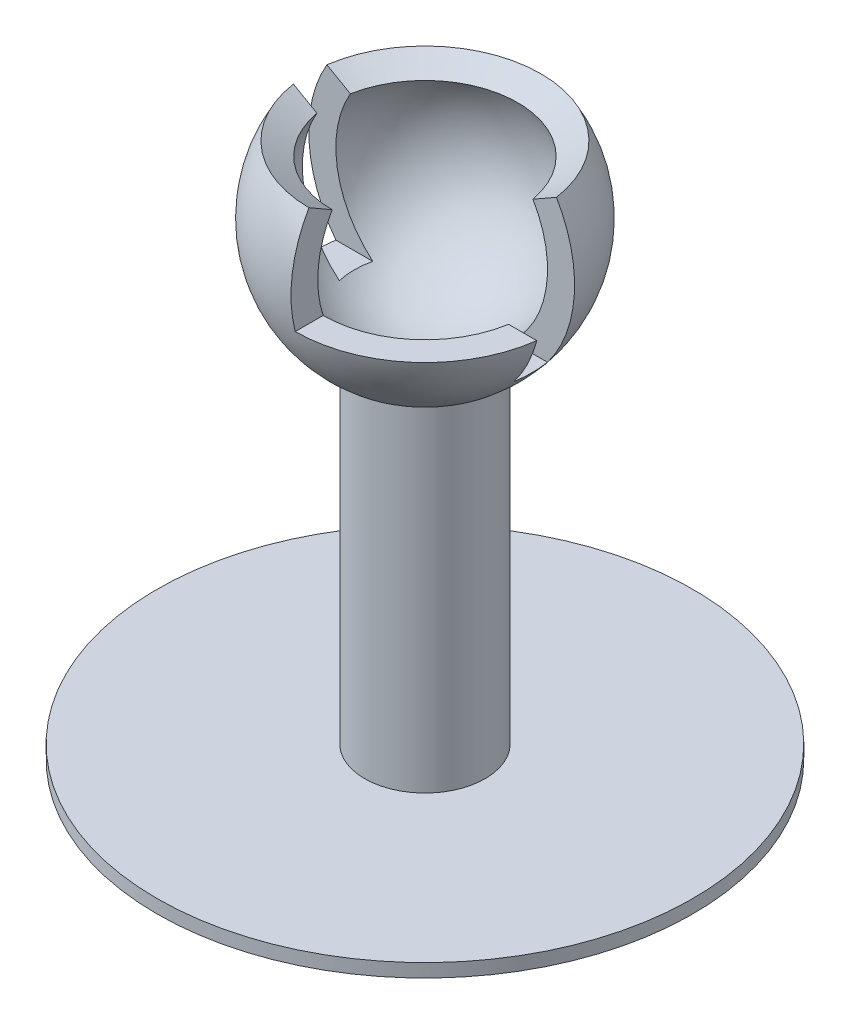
ISO-10303-21;
HEADER;
FILE_DESCRIPTION(('STEP AP214'),'2;1');
FILE_NAME('part.step','',(''),(''),'','','');
FILE_SCHEMA(('AUTOMOTIVE_DESIGN { 1 0 10303 214 1 1 1 1 }'));
ENDSEC;
DATA;
#1=APPLICATION_CONTEXT('core data for automotive mechanical design processes');
#2=APPLICATION_PROTOCOL_DEFINITION('international standard','automotive_design',2000,#1);
#3=PRODUCT_CONTEXT('',#1,'mechanical');
#4=PRODUCT('Part','Part','',(#3));
#5=PRODUCT_RELATED_PRODUCT_CATEGORY('part','',(#4));
#6=PRODUCT_DEFINITION_FORMATION('','',#4);
#7=PRODUCT_DEFINITION_CONTEXT('part definition',#1,'design');
#8=PRODUCT_DEFINITION('design','',#6,#7);
#9=PRODUCT_DEFINITION_SHAPE('','',#8);
#10=(LENGTH_UNIT() NAMED_UNIT(*) SI_UNIT(.MILLI.,.METRE.));
#11=(NAMED_UNIT(*) PLANE_ANGLE_UNIT() SI_UNIT($,.RADIAN.));
#12=(NAMED_UNIT(*) SI_UNIT($,.STERADIAN.) SOLID_ANGLE_UNIT());
#13=UNCERTAINTY_MEASURE_WITH_UNIT(LENGTH_MEASURE(1.E-05),#10,'distance_accuracy_value','');
#14=(GEOMETRIC_REPRESENTATION_CONTEXT(3) GLOBAL_UNCERTAINTY_ASSIGNED_CONTEXT((#13)) GLOBAL_UNIT_ASSIGNED_CONTEXT((#10,
#11,#12)) REPRESENTATION_CONTEXT('',''));
#15=CARTESIAN_POINT('',(0.,0.,0.));
#16=DIRECTION('',(0.,0.,1.));
#17=DIRECTION('',(1.,0.,0.));
#18=AXIS2_PLACEMENT_3D('',#15,#16,#17);
#19=CARTESIAN_POINT('',(0.,0.,0.));
#20=DIRECTION('',(0.,1.,0.));
#21=DIRECTION('',(-1.,0.,0.));
#22=AXIS2_PLACEMENT_3D('',#19,#20,#21);
#23=SPHERICAL_SURFACE('',#22,20.);
#24=CARTESIAN_POINT('',(0.,-17.8605710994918,0.));
#25=DIRECTION('',(0.,1.,0.));
#26=DIRECTION('',(0.,0.,1.));
#27=AXIS2_PLACEMENT_3D('',#24,#25,#26);
#28=CIRCLE('',#27,9.);
#29=CARTESIAN_POINT('',(0.,-17.8605710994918,9.));
#30=VERTEX_POINT('',#29);
#31=EDGE_CURVE('E139',#30,#30,#28,.T.);
#32=ORIENTED_EDGE('',*,*,#31,.T.);
#33=EDGE_LOOP('',(#32));
#34=FACE_BOUND('',#33,.T.);
#35=CARTESIAN_POINT('',(0.,-12.,0.));
#36=DIRECTION('',(0.,-1.,0.));
#37=DIRECTION('',(0.,0.,-1.));
#38=AXIS2_PLACEMENT_3D('',#35,#36,#37);
#39=CIRCLE('',#38,16.);
#40=CARTESIAN_POINT('',(-15.8034806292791,-12.,2.5));
#41=VERTEX_POINT('',#40);
#42=CARTESIAN_POINT('',(-15.8034806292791,-12.,-2.5));
#43=VERTEX_POINT('',#42);
#44=EDGE_CURVE('E120',#41,#43,#39,.T.);
#45=ORIENTED_EDGE('',*,*,#44,.T.);
#46=CARTESIAN_POINT('',(0.,0.,-2.5));
#47=DIRECTION('',(0.,0.,1.));
#48=DIRECTION('',(1.,0.,0.));
#49=AXIS2_PLACEMENT_3D('',#46,#47,#48);
#50=CIRCLE('',#49,19.8431348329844);
#51=CARTESIAN_POINT('',(-17.1391365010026,10.0000000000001,-2.5));
#52=VERTEX_POINT('',#51);
#53=EDGE_CURVE('E123',#52,#43,#50,.T.);
#54=ORIENTED_EDGE('',*,*,#53,.F.);
#55=CARTESIAN_POINT('',(0.,10.0000000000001,0.));
#56=DIRECTION('',(0.,1.,0.));
#57=DIRECTION('',(0.,0.,1.));
#58=AXIS2_PLACEMENT_3D('',#55,#56,#57);
#59=CIRCLE('',#58,17.3205080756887);
#60=CARTESIAN_POINT('',(17.1391365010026,10.0000000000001,-2.5));
#61=VERTEX_POINT('',#60);
#62=EDGE_CURVE('E129',#61,#52,#59,.T.);
#63=ORIENTED_EDGE('',*,*,#62,.F.);
#64=CARTESIAN_POINT('',(15.8034806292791,-12.,-2.5));
#65=VERTEX_POINT('',#64);
#66=EDGE_CURVE('E111',#65,#61,#50,.T.);
#67=ORIENTED_EDGE('',*,*,#66,.F.);
#68=CARTESIAN_POINT('',(15.8034806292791,-12.,2.5));
#69=VERTEX_POINT('',#68);
#70=EDGE_CURVE('E191',#65,#69,#39,.T.);
#71=ORIENTED_EDGE('',*,*,#70,.T.);
#72=CARTESIAN_POINT('',(0.,0.,2.5));
#73=DIRECTION('',(0.,0.,1.));
#74=DIRECTION('',(1.,0.,0.));
#75=AXIS2_PLACEMENT_3D('',#72,#73,#74);
#76=CIRCLE('',#75,19.8431348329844);
#77=CARTESIAN_POINT('',(19.2028643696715,-4.99999999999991,2.5));
#78=VERTEX_POINT('',#77);
#79=EDGE_CURVE('E187',#69,#78,#76,.T.);
#80=ORIENTED_EDGE('',*,*,#79,.T.);
#81=CARTESIAN_POINT('',(0.,-4.99999999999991,0.));
#82=DIRECTION('',(0.,1.,0.));
#83=DIRECTION('',(0.,0.,1.));
#84=AXIS2_PLACEMENT_3D('',#81,#82,#83);
#85=CIRCLE('',#84,19.3649167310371);
#86=CARTESIAN_POINT('',(0.,-4.99999999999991,19.3649167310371));
#87=VERTEX_POINT('',#86);
#88=EDGE_CURVE('E200',#87,#78,#85,.T.);
#89=ORIENTED_EDGE('',*,*,#88,.F.);
#90=CARTESIAN_POINT('',(0.,0.,0.));
#91=DIRECTION('',(1.,0.,0.));
#92=DIRECTION('',(0.,0.,-1.));
#93=AXIS2_PLACEMENT_3D('',#90,#91,#92);
#94=CIRCLE('',#93,20.);
#95=CARTESIAN_POINT('',(0.,10.0000000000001,17.3205080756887));
#96=VERTEX_POINT('',#95);
#97=EDGE_CURVE('E199',#96,#87,#94,.T.);
#98=ORIENTED_EDGE('',*,*,#97,.F.);
#99=CARTESIAN_POINT('',(-17.1391365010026,10.0000000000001,2.5));
#100=VERTEX_POINT('',#99);
#101=EDGE_CURVE('E136',#100,#96,#59,.T.);
#102=ORIENTED_EDGE('',*,*,#101,.F.);
#103=EDGE_CURVE('E47',#100,#41,#76,.T.);
#104=ORIENTED_EDGE('',*,*,#103,.T.);
#105=EDGE_LOOP('',(#45,#54,#63,#67,#71,#80,#89,#98,#102,#104));
#106=FACE_BOUND('',#105,.T.);
#107=ADVANCED_FACE('F32',(#34,#106),#23,.T.);
#108=CARTESIAN_POINT('',(0.,0.,0.));
#109=DIRECTION('',(0.,1.,0.));
#110=DIRECTION('',(1.,0.,0.));
#111=AXIS2_PLACEMENT_3D('',#108,#109,#110);
#112=SPHERICAL_SURFACE('',#111,16.);
#113=CARTESIAN_POINT('',(0.,0.,-2.5));
#114=DIRECTION('',(0.,0.,1.));
#115=DIRECTION('',(1.,0.,0.));
#116=AXIS2_PLACEMENT_3D('',#113,#114,#115);
#117=CIRCLE('',#116,15.8034806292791);
#118=CARTESIAN_POINT('',(-10.2834819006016,-12.,-2.5));
#119=VERTEX_POINT('',#118);
#120=CARTESIAN_POINT('',(-13.629013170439,8.00000000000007,-2.5));
#121=VERTEX_POINT('',#120);
#122=EDGE_CURVE('E189',#119,#121,#117,.F.);
#123=ORIENTED_EDGE('',*,*,#122,.F.);
#124=CARTESIAN_POINT('',(0.,-12.,0.));
#125=DIRECTION('',(0.,-1.,0.));
#126=DIRECTION('',(0.,0.,-1.));
#127=AXIS2_PLACEMENT_3D('',#124,#125,#126);
#128=CIRCLE('',#127,10.5830052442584);
#129=CARTESIAN_POINT('',(-10.2834819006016,-12.,2.5));
#130=VERTEX_POINT('',#129);
#131=EDGE_CURVE('E11',#119,#130,#128,.F.);
#132=ORIENTED_EDGE('',*,*,#131,.T.);
#133=CARTESIAN_POINT('',(0.,0.,2.5));
#134=DIRECTION('',(0.,0.,1.));
#135=DIRECTION('',(1.,0.,0.));
#136=AXIS2_PLACEMENT_3D('',#133,#134,#135);
#137=CIRCLE('',#136,15.8034806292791);
#138=CARTESIAN_POINT('',(-13.629013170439,8.00000000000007,2.5));
#139=VERTEX_POINT('',#138);
#140=EDGE_CURVE('E186',#130,#139,#137,.F.);
#141=ORIENTED_EDGE('',*,*,#140,.T.);
#142=CARTESIAN_POINT('',(0.,8.00000000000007,0.));
#143=DIRECTION('',(0.,1.,0.));
#144=DIRECTION('',(0.,0.,1.));
#145=AXIS2_PLACEMENT_3D('',#142,#143,#144);
#146=CIRCLE('',#145,13.856406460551);
#147=CARTESIAN_POINT('',(0.,8.00000000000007,13.856406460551));
#148=VERTEX_POINT('',#147);
#149=EDGE_CURVE('E142',#139,#148,#146,.T.);
#150=ORIENTED_EDGE('',*,*,#149,.T.);
#151=CARTESIAN_POINT('',(0.,0.,0.));
#152=DIRECTION('',(1.,0.,0.));
#153=DIRECTION('',(0.,0.,-1.));
#154=AXIS2_PLACEMENT_3D('',#151,#152,#153);
#155=CIRCLE('',#154,16.);
#156=CARTESIAN_POINT('',(0.,-4.99999999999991,15.1986841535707));
#157=VERTEX_POINT('',#156);
#158=EDGE_CURVE('E196',#157,#148,#155,.F.);
#159=ORIENTED_EDGE('',*,*,#158,.F.);
#160=CARTESIAN_POINT('',(0.,-4.99999999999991,0.));
#161=DIRECTION('',(0.,1.,0.));
#162=DIRECTION('',(0.,0.,1.));
#163=AXIS2_PLACEMENT_3D('',#160,#161,#162);
#164=CIRCLE('',#163,15.1986841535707);
#165=CARTESIAN_POINT('',(14.991664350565,-4.99999999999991,2.5));
#166=VERTEX_POINT('',#165);
#167=EDGE_CURVE('E156',#166,#157,#164,.F.);
#168=ORIENTED_EDGE('',*,*,#167,.F.);
#169=CARTESIAN_POINT('',(10.2834819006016,-12.,2.5));
#170=VERTEX_POINT('',#169);
#171=EDGE_CURVE('E55',#166,#170,#137,.F.);
#172=ORIENTED_EDGE('',*,*,#171,.T.);
#173=CARTESIAN_POINT('',(10.2834819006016,-12.,-2.5));
#174=VERTEX_POINT('',#173);
#175=EDGE_CURVE('E36',#170,#174,#128,.F.);
#176=ORIENTED_EDGE('',*,*,#175,.T.);
#177=CARTESIAN_POINT('',(13.629013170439,8.00000000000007,-2.5));
#178=VERTEX_POINT('',#177);
#179=EDGE_CURVE('E121',#178,#174,#117,.F.);
#180=ORIENTED_EDGE('',*,*,#179,.F.);
#181=EDGE_CURVE('E131',#178,#121,#146,.T.);
#182=ORIENTED_EDGE('',*,*,#181,.T.);
#183=EDGE_LOOP('',(#123,#132,#141,#150,#159,#168,#172,#176,#180,#182));
#184=FACE_BOUND('',#183,.T.);
#185=ADVANCED_FACE('F210',(#184),#112,.F.);
#186=CARTESIAN_POINT('',(0.,10.0000000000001,0.));
#187=DIRECTION('',(0.,1.,0.));
#188=DIRECTION('',(0.,0.,1.));
#189=AXIS2_PLACEMENT_3D('',#186,#187,#188);
#190=CONICAL_SURFACE('',#189,17.3205080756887,1.04719755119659);
#191=CARTESIAN_POINT('',(38.1399299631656,22.067353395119,-2.5));
#192=CARTESIAN_POINT('',(36.528434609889,21.1389795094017,-2.5));
#193=CARTESIAN_POINT('',(34.9168557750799,20.210750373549,-2.5));
#194=CARTESIAN_POINT('',(31.693357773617,18.3548670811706,-2.5));
#195=CARTESIAN_POINT('',(30.0814386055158,17.4272129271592,-2.5));
#196=CARTESIAN_POINT('',(26.8576469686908,15.5730874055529,-2.5));
#197=CARTESIAN_POINT('',(25.245774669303,14.6466157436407,-2.5));
#198=CARTESIAN_POINT('',(22.8273059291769,13.2580647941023,-2.5));
#199=CARTESIAN_POINT('',(22.0210410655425,12.7954080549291,-2.5));
#200=CARTESIAN_POINT('',(20.4082027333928,11.8706329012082,-2.5));
#201=CARTESIAN_POINT('',(19.601629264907,11.408514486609,-2.5));
#202=CARTESIAN_POINT('',(17.9945390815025,10.4887598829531,-2.5));
#203=CARTESIAN_POINT('',(17.194025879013,10.0311175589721,-2.5));
#204=CARTESIAN_POINT('',(15.5923488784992,9.11695779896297,-2.5));
#205=CARTESIAN_POINT('',(14.7911850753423,8.66044037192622,-2.5));
#206=CARTESIAN_POINT('',(13.1876519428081,7.74906216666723,-2.5));
#207=CARTESIAN_POINT('',(12.3852823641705,7.29420182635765,-2.5));
#208=CARTESIAN_POINT('',(11.1804204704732,6.61424680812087,-2.5));
#209=CARTESIAN_POINT('',(10.7785860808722,6.3879867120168,-2.5));
#210=CARTESIAN_POINT('',(9.97430907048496,5.93655056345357,-2.5));
#211=CARTESIAN_POINT('',(9.57186645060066,5.71137450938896,-2.5));
#212=CARTESIAN_POINT('',(8.76539294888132,5.26215549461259,-2.5));
#213=CARTESIAN_POINT('',(8.3613605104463,5.0381153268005,-2.5));
#214=CARTESIAN_POINT('',(7.55200930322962,4.59231108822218,-2.5));
#215=CARTESIAN_POINT('',(7.14669046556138,4.37054714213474,-2.5));
#216=CARTESIAN_POINT('',(6.53730670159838,4.0406877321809,-2.5));
#217=CARTESIAN_POINT('',(6.33398481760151,3.93122035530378,-2.5));
#218=CARTESIAN_POINT('',(5.92670171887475,3.7134822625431,-2.5));
#219=CARTESIAN_POINT('',(5.72274050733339,3.60521154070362,-2.5));
#220=CARTESIAN_POINT('',(5.31400817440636,3.39025893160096,-2.5));
#221=CARTESIAN_POINT('',(5.10923713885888,3.28357688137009,-2.5));
#222=CARTESIAN_POINT('',(4.69859511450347,3.07235403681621,-2.5));
#223=CARTESIAN_POINT('',(4.49272414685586,2.96781320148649,-2.5));
#224=CARTESIAN_POINT('',(4.07877108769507,2.7613673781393,-2.5));
#225=CARTESIAN_POINT('',(3.87068381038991,2.65947276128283,-2.5));
#226=CARTESIAN_POINT('',(3.452375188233,2.46000615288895,-2.5));
#227=CARTESIAN_POINT('',(3.24215342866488,2.36243502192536,-2.5));
#228=CARTESIAN_POINT('',(2.92429082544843,2.22088312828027,-2.5));
#229=CARTESIAN_POINT('',(2.81775118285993,2.17443307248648,-2.5));
#230=CARTESIAN_POINT('',(2.60378773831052,2.08362142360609,-2.5));
#231=CARTESIAN_POINT('',(2.49636397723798,2.03925973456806,-2.5));
#232=CARTESIAN_POINT('',(2.28048541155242,1.95316183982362,-2.5));
#233=CARTESIAN_POINT('',(2.17203079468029,1.91142516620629,-2.5));
#234=CARTESIAN_POINT('',(1.95390740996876,1.83127288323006,-2.5));
#235=CARTESIAN_POINT('',(1.84423875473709,1.79285696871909,-2.5));
#236=CARTESIAN_POINT('',(1.5923796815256,1.70998392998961,-2.5));
#237=CARTESIAN_POINT('',(1.44973672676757,1.66687673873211,-2.5));
#238=CARTESIAN_POINT('',(1.16192986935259,1.58995210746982,-2.5));
#239=CARTESIAN_POINT('',(1.01676626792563,1.5561335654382,-2.5));
#240=CARTESIAN_POINT('',(0.725503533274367,1.50085303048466,-2.5));
#241=CARTESIAN_POINT('',(0.579427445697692,1.47927338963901,-2.5));
#242=CARTESIAN_POINT('',(0.285871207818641,1.45038766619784,-2.5));
#243=CARTESIAN_POINT('',(0.138391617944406,1.44307610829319,-2.5));
#244=CARTESIAN_POINT('',(-0.157411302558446,1.44369607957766,-2.5));
#245=CARTESIAN_POINT('',(-0.305734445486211,1.4517183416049,-2.5));
#246=CARTESIAN_POINT('',(-0.600895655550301,1.48210612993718,-2.5));
#247=CARTESIAN_POINT('',(-0.747733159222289,1.50447690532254,-2.5));
#248=CARTESIAN_POINT('',(-1.04062769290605,1.56136887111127,-2.5));
#249=CARTESIAN_POINT('',(-1.18665887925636,1.59601952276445,-2.5));
#250=CARTESIAN_POINT('',(-1.40376457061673,1.65493978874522,-2.5));
#251=CARTESIAN_POINT('',(-1.47581556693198,1.67573928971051,-2.5));
#252=CARTESIAN_POINT('',(-1.61930539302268,1.71934410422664,-2.5));
#253=CARTESIAN_POINT('',(-1.69074425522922,1.74214931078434,-2.5));
#254=CARTESIAN_POINT('',(-1.90934407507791,1.81484871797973,-2.5));
#255=CARTESIAN_POINT('',(-2.05556439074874,1.86756978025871,-2.5));
#256=CARTESIAN_POINT('',(-2.34597632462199,1.97836143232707,-2.5));
#257=CARTESIAN_POINT('',(-2.49016737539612,2.03643348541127,-2.5));
#258=CARTESIAN_POINT('',(-2.77703462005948,2.15655339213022,-2.5));
#259=CARTESIAN_POINT('',(-2.91970925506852,2.21860494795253,-2.5));
#260=CARTESIAN_POINT('',(-3.20373046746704,2.34562240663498,-2.5));
#261=CARTESIAN_POINT('',(-3.34507717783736,2.4105880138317,-2.5));
#262=CARTESIAN_POINT('',(-3.62711455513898,2.54291100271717,-2.5));
#263=CARTESIAN_POINT('',(-3.76780237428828,2.61027443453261,-2.5));
#264=CARTESIAN_POINT('',(-4.04834382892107,2.7467191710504,-2.5));
#265=CARTESIAN_POINT('',(-4.18819744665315,2.81580051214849,-2.5));
#266=CARTESIAN_POINT('',(-4.60660912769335,3.02496476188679,-2.5));
#267=CARTESIAN_POINT('',(-4.88416998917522,3.16704027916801,-2.5));
#268=CARTESIAN_POINT('',(-5.4381552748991,3.4549030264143,-2.5));
#269=CARTESIAN_POINT('',(-5.7145756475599,3.60069800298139,-2.5));
#270=CARTESIAN_POINT('',(-6.26621665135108,3.8946201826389,-2.5));
#271=CARTESIAN_POINT('',(-6.54143712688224,4.0427476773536,-2.5));
#272=CARTESIAN_POINT('',(-7.09050544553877,4.34036745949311,-2.5));
#273=CARTESIAN_POINT('',(-7.36435485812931,4.48985685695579,-2.5));
#274=CARTESIAN_POINT('',(-7.91138844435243,4.79001982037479,-2.5));
#275=CARTESIAN_POINT('',(-8.18457264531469,4.94069333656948,-2.5));
#276=CARTESIAN_POINT('',(-8.99772941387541,5.39090126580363,-2.5));
#277=CARTESIAN_POINT('',(-9.53698937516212,5.691722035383,-2.5));
#278=CARTESIAN_POINT('',(-10.6143454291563,6.29544185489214,-2.5));
#279=CARTESIAN_POINT('',(-11.152441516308,6.59834091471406,-2.5));
#280=CARTESIAN_POINT('',(-12.2278758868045,7.20551412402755,-2.5));
#281=CARTESIAN_POINT('',(-12.7652141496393,7.50978830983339,-2.5));
#282=CARTESIAN_POINT('',(-13.8393564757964,8.11927839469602,-2.5));
#283=CARTESIAN_POINT('',(-14.3761605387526,8.4244942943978,-2.5));
#284=CARTESIAN_POINT('',(-15.9867310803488,9.34154906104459,-2.5));
#285=CARTESIAN_POINT('',(-17.059930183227,9.95438413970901,-2.5));
#286=CARTESIAN_POINT('',(-19.2054726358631,11.1815208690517,-2.5));
#287=CARTESIAN_POINT('',(-20.2778159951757,11.7958225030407,-2.5));
#288=CARTESIAN_POINT('',(-22.4191802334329,13.0237496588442,-2.5));
#289=CARTESIAN_POINT('',(-23.4882024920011,13.6373727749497,-2.5));
#290=CARTESIAN_POINT('',(-25.6259002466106,14.8652299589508,-2.5));
#291=CARTESIAN_POINT('',(-26.694575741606,15.4794640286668,-2.5));
#292=CARTESIAN_POINT('',(-29.8999014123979,17.3225947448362,-2.5));
#293=CARTESIAN_POINT('',(-32.0361924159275,18.5521159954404,-2.5));
#294=CARTESIAN_POINT('',(-34.5027933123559,19.9724161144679,-2.5));
#295=CARTESIAN_POINT('',(-34.8333490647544,20.1627682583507,-2.5));
#296=CARTESIAN_POINT('',(-35.4944549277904,20.5434966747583,-2.5));
#297=CARTESIAN_POINT('',(-35.8250050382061,20.7338729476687,-2.5));
#298=CARTESIAN_POINT('',(-36.486293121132,21.114758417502,-2.5));
#299=CARTESIAN_POINT('',(-36.817031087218,21.3052676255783,-2.5));
#300=CARTESIAN_POINT('',(-37.4784908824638,21.6862997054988,-2.5));
#301=CARTESIAN_POINT('',(-37.80921271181,21.8768225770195,-2.5));
#302=CARTESIAN_POINT('',(-38.1399299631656,22.067353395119,-2.5));
#303=B_SPLINE_CURVE_WITH_KNOTS('',3,(#191,#192,#193,#194,#195,#196,#197,#198,#199,#200,#201,
#202,#203,#204,#205,#206,#207,#208,#209,#210,#211,#212,#213,#214,#215,#216,#217,#218,#219,#220,
#221,#222,#223,#224,#225,#226,#227,#228,#229,#230,#231,#232,#233,#234,#235,#236,#237,#238,#239,
#240,#241,#242,#243,#244,#245,#246,#247,#248,#249,#250,#251,#252,#253,#254,#255,#256,#257,#258,
#259,#260,#261,#262,#263,#264,#265,#266,#267,#268,#269,#270,#271,#272,#273,#274,#275,#276,#277,
#278,#279,#280,#281,#282,#283,#284,#285,#286,#287,#288,#289,#290,#291,#292,#293,#294,#295,#296,
#297,#298,#299,#300,#301,#302),.UNSPECIFIED.,.F.,.F.,(4,2,2,2,2,2,2,2,2,2,2,2,2,2,2,2,2,2,2,2,2,
2,2,2,2,2,2,2,2,2,2,2,2,2,2,2,2,2,2,2,2,2,2,2,2,2,2,2,2,2,2,2,2,2,2,4),(0.,5.57935114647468,
11.1587265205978,16.7362108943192,19.5249431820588,22.3136752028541,25.0799574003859,
27.8462616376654,30.6132504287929,31.9967162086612,33.3801799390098,34.766150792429,
36.1521971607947,36.8449468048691,37.5376929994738,38.2303676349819,38.9230289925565,
39.6180868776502,40.3132824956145,40.6619412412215,41.0105839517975,41.3591643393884,
41.7077126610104,42.1545196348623,42.601273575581,43.0436569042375,43.485870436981,
43.9307087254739,44.375709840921,44.8255492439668,45.0505065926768,45.275451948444,
45.7415919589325,46.2078598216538,46.6745679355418,47.1412288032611,47.6091647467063,
48.077110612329,49.0124974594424,49.9500238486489,50.8876683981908,51.82364825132,
52.7595889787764,54.6120511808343,56.4645222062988,58.3170424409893,60.1695639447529,
63.8771088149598,67.5846116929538,71.2824590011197,74.9803173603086,82.3748523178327,
83.5191902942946,84.6635497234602,85.8085965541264,86.9536218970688),.UNSPECIFIED.);
#304=EDGE_CURVE('E114',#61,#178,#303,.T.);
#305=ORIENTED_EDGE('',*,*,#304,.F.);
#306=ORIENTED_EDGE('',*,*,#62,.T.);
#307=EDGE_CURVE('E132',#121,#52,#303,.T.);
#308=ORIENTED_EDGE('',*,*,#307,.F.);
#309=ORIENTED_EDGE('',*,*,#181,.F.);
#310=EDGE_LOOP('',(#305,#306,#308,#309));
#311=FACE_BOUND('',#310,.T.);
#312=ADVANCED_FACE('F127',(#311),#190,.F.);
#313=ORIENTED_EDGE('',*,*,#149,.F.);
#314=CARTESIAN_POINT('',(38.1399299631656,22.067353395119,2.5));
#315=CARTESIAN_POINT('',(36.528434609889,21.1389795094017,2.5));
#316=CARTESIAN_POINT('',(34.9168557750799,20.210750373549,2.5));
#317=CARTESIAN_POINT('',(31.693357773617,18.3548670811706,2.5));
#318=CARTESIAN_POINT('',(30.0814386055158,17.4272129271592,2.5));
#319=CARTESIAN_POINT('',(26.8576469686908,15.5730874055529,2.5));
#320=CARTESIAN_POINT('',(25.245774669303,14.6466157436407,2.5));
#321=CARTESIAN_POINT('',(22.8273059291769,13.2580647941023,2.5));
#322=CARTESIAN_POINT('',(22.0210410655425,12.7954080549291,2.5));
#323=CARTESIAN_POINT('',(20.4082027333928,11.8706329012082,2.5));
#324=CARTESIAN_POINT('',(19.601629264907,11.408514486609,2.5));
#325=CARTESIAN_POINT('',(17.9945390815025,10.4887598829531,2.5));
#326=CARTESIAN_POINT('',(17.194025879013,10.0311175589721,2.5));
#327=CARTESIAN_POINT('',(15.5923488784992,9.11695779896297,2.5));
#328=CARTESIAN_POINT('',(14.7911850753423,8.66044037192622,2.5));
#329=CARTESIAN_POINT('',(13.1876519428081,7.74906216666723,2.5));
#330=CARTESIAN_POINT('',(12.3852823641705,7.29420182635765,2.5));
#331=CARTESIAN_POINT('',(11.1804204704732,6.61424680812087,2.5));
#332=CARTESIAN_POINT('',(10.7785860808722,6.3879867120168,2.5));
#333=CARTESIAN_POINT('',(9.97430907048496,5.93655056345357,2.5));
#334=CARTESIAN_POINT('',(9.57186645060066,5.71137450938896,2.5));
#335=CARTESIAN_POINT('',(8.76539294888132,5.26215549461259,2.5));
#336=CARTESIAN_POINT('',(8.3613605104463,5.0381153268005,2.5));
#337=CARTESIAN_POINT('',(7.55200930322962,4.59231108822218,2.5));
#338=CARTESIAN_POINT('',(7.14669046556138,4.37054714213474,2.5));
#339=CARTESIAN_POINT('',(6.53730670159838,4.0406877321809,2.5));
#340=CARTESIAN_POINT('',(6.33398481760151,3.93122035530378,2.5));
#341=CARTESIAN_POINT('',(5.92670171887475,3.7134822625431,2.5));
#342=CARTESIAN_POINT('',(5.72274050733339,3.60521154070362,2.5));
#343=CARTESIAN_POINT('',(5.31400817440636,3.39025893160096,2.5));
#344=CARTESIAN_POINT('',(5.10923713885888,3.28357688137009,2.5));
#345=CARTESIAN_POINT('',(4.69859511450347,3.07235403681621,2.5));
#346=CARTESIAN_POINT('',(4.49272414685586,2.96781320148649,2.5));
#347=CARTESIAN_POINT('',(4.07877108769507,2.7613673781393,2.5));
#348=CARTESIAN_POINT('',(3.87068381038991,2.65947276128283,2.5));
#349=CARTESIAN_POINT('',(3.452375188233,2.46000615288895,2.5));
#350=CARTESIAN_POINT('',(3.24215342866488,2.36243502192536,2.5));
#351=CARTESIAN_POINT('',(2.92429082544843,2.22088312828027,2.5));
#352=CARTESIAN_POINT('',(2.81775118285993,2.17443307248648,2.5));
#353=CARTESIAN_POINT('',(2.60378773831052,2.08362142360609,2.5));
#354=CARTESIAN_POINT('',(2.49636397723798,2.03925973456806,2.5));
#355=CARTESIAN_POINT('',(2.28048541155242,1.95316183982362,2.5));
#356=CARTESIAN_POINT('',(2.17203079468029,1.91142516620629,2.5));
#357=CARTESIAN_POINT('',(1.95390740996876,1.83127288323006,2.5));
#358=CARTESIAN_POINT('',(1.84423875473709,1.79285696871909,2.5));
#359=CARTESIAN_POINT('',(1.5923796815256,1.70998392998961,2.5));
#360=CARTESIAN_POINT('',(1.44973672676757,1.66687673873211,2.5));
#361=CARTESIAN_POINT('',(1.16192986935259,1.58995210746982,2.5));
#362=CARTESIAN_POINT('',(1.01676626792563,1.5561335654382,2.5));
#363=CARTESIAN_POINT('',(0.725503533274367,1.50085303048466,2.5));
#364=CARTESIAN_POINT('',(0.579427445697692,1.47927338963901,2.5));
#365=CARTESIAN_POINT('',(0.285871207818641,1.45038766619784,2.5));
#366=CARTESIAN_POINT('',(0.138391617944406,1.44307610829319,2.5));
#367=CARTESIAN_POINT('',(-0.157411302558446,1.44369607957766,2.5));
#368=CARTESIAN_POINT('',(-0.305734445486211,1.4517183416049,2.5));
#369=CARTESIAN_POINT('',(-0.600895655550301,1.48210612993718,2.5));
#370=CARTESIAN_POINT('',(-0.747733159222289,1.50447690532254,2.5));
#371=CARTESIAN_POINT('',(-1.04062769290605,1.56136887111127,2.5));
#372=CARTESIAN_POINT('',(-1.18665887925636,1.59601952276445,2.5));
#373=CARTESIAN_POINT('',(-1.40376457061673,1.65493978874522,2.5));
#374=CARTESIAN_POINT('',(-1.47581556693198,1.67573928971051,2.5));
#375=CARTESIAN_POINT('',(-1.61930539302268,1.71934410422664,2.5));
#376=CARTESIAN_POINT('',(-1.69074425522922,1.74214931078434,2.5));
#377=CARTESIAN_POINT('',(-1.90934407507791,1.81484871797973,2.5));
#378=CARTESIAN_POINT('',(-2.05556439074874,1.86756978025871,2.5));
#379=CARTESIAN_POINT('',(-2.34597632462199,1.97836143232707,2.5));
#380=CARTESIAN_POINT('',(-2.49016737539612,2.03643348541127,2.5));
#381=CARTESIAN_POINT('',(-2.77703462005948,2.15655339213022,2.5));
#382=CARTESIAN_POINT('',(-2.91970925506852,2.21860494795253,2.5));
#383=CARTESIAN_POINT('',(-3.20373046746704,2.34562240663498,2.5));
#384=CARTESIAN_POINT('',(-3.34507717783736,2.4105880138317,2.5));
#385=CARTESIAN_POINT('',(-3.62711455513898,2.54291100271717,2.5));
#386=CARTESIAN_POINT('',(-3.76780237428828,2.61027443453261,2.5));
#387=CARTESIAN_POINT('',(-4.04834382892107,2.7467191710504,2.5));
#388=CARTESIAN_POINT('',(-4.18819744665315,2.81580051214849,2.5));
#389=CARTESIAN_POINT('',(-4.60660912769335,3.02496476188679,2.5));
#390=CARTESIAN_POINT('',(-4.88416998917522,3.16704027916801,2.5));
#391=CARTESIAN_POINT('',(-5.4381552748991,3.4549030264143,2.5));
#392=CARTESIAN_POINT('',(-5.7145756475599,3.60069800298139,2.5));
#393=CARTESIAN_POINT('',(-6.26621665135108,3.8946201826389,2.5));
#394=CARTESIAN_POINT('',(-6.54143712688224,4.0427476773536,2.5));
#395=CARTESIAN_POINT('',(-7.09050544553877,4.34036745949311,2.5));
#396=CARTESIAN_POINT('',(-7.36435485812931,4.48985685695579,2.5));
#397=CARTESIAN_POINT('',(-7.91138844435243,4.79001982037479,2.5));
#398=CARTESIAN_POINT('',(-8.18457264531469,4.94069333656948,2.5));
#399=CARTESIAN_POINT('',(-8.99772941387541,5.39090126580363,2.5));
#400=CARTESIAN_POINT('',(-9.53698937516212,5.691722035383,2.5));
#401=CARTESIAN_POINT('',(-10.6143454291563,6.29544185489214,2.5));
#402=CARTESIAN_POINT('',(-11.152441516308,6.59834091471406,2.5));
#403=CARTESIAN_POINT('',(-12.2278758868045,7.20551412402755,2.5));
#404=CARTESIAN_POINT('',(-12.7652141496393,7.50978830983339,2.5));
#405=CARTESIAN_POINT('',(-13.8393564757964,8.11927839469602,2.5));
#406=CARTESIAN_POINT('',(-14.3761605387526,8.4244942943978,2.5));
#407=CARTESIAN_POINT('',(-15.9867310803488,9.34154906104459,2.5));
#408=CARTESIAN_POINT('',(-17.059930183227,9.95438413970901,2.5));
#409=CARTESIAN_POINT('',(-19.2054726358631,11.1815208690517,2.5));
#410=CARTESIAN_POINT('',(-20.2778159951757,11.7958225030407,2.5));
#411=CARTESIAN_POINT('',(-22.4191802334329,13.0237496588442,2.5));
#412=CARTESIAN_POINT('',(-23.4882024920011,13.6373727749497,2.5));
#413=CARTESIAN_POINT('',(-25.6259002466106,14.8652299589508,2.5));
#414=CARTESIAN_POINT('',(-26.694575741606,15.4794640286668,2.5));
#415=CARTESIAN_POINT('',(-29.8999014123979,17.3225947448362,2.5));
#416=CARTESIAN_POINT('',(-32.0361924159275,18.5521159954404,2.5));
#417=CARTESIAN_POINT('',(-34.5027933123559,19.9724161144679,2.5));
#418=CARTESIAN_POINT('',(-34.8333490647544,20.1627682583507,2.5));
#419=CARTESIAN_POINT('',(-35.4944549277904,20.5434966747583,2.5));
#420=CARTESIAN_POINT('',(-35.8250050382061,20.7338729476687,2.5));
#421=CARTESIAN_POINT('',(-36.486293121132,21.114758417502,2.5));
#422=CARTESIAN_POINT('',(-36.817031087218,21.3052676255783,2.5));
#423=CARTESIAN_POINT('',(-37.4784908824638,21.6862997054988,2.5));
#424=CARTESIAN_POINT('',(-37.80921271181,21.8768225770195,2.5));
#425=CARTESIAN_POINT('',(-38.1399299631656,22.067353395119,2.5));
#426=B_SPLINE_CURVE_WITH_KNOTS('',3,(#314,#315,#316,#317,#318,#319,#320,#321,#322,#323,#324,
#325,#326,#327,#328,#329,#330,#331,#332,#333,#334,#335,#336,#337,#338,#339,#340,#341,#342,#343,
#344,#345,#346,#347,#348,#349,#350,#351,#352,#353,#354,#355,#356,#357,#358,#359,#360,#361,#362,
#363,#364,#365,#366,#367,#368,#369,#370,#371,#372,#373,#374,#375,#376,#377,#378,#379,#380,#381,
#382,#383,#384,#385,#386,#387,#388,#389,#390,#391,#392,#393,#394,#395,#396,#397,#398,#399,#400,
#401,#402,#403,#404,#405,#406,#407,#408,#409,#410,#411,#412,#413,#414,#415,#416,#417,#418,#419,
#420,#421,#422,#423,#424,#425),.UNSPECIFIED.,.F.,.F.,(4,2,2,2,2,2,2,2,2,2,2,2,2,2,2,2,2,2,2,2,2,
2,2,2,2,2,2,2,2,2,2,2,2,2,2,2,2,2,2,2,2,2,2,2,2,2,2,2,2,2,2,2,2,2,2,4),(0.,5.57935114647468,
11.1587265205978,16.7362108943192,19.5249431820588,22.3136752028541,25.0799574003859,
27.8462616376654,30.6132504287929,31.9967162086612,33.3801799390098,34.766150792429,
36.1521971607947,36.8449468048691,37.5376929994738,38.2303676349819,38.9230289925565,
39.6180868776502,40.3132824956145,40.6619412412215,41.0105839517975,41.3591643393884,
41.7077126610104,42.1545196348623,42.601273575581,43.0436569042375,43.485870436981,
43.9307087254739,44.375709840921,44.8255492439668,45.0505065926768,45.275451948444,
45.7415919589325,46.2078598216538,46.6745679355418,47.1412288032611,47.6091647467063,
48.077110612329,49.0124974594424,49.9500238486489,50.8876683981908,51.82364825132,
52.7595889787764,54.6120511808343,56.4645222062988,58.3170424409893,60.1695639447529,
63.8771088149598,67.5846116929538,71.2824590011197,74.9803173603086,82.3748523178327,
83.5191902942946,84.6635497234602,85.8085965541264,86.9536218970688),.UNSPECIFIED.);
#427=EDGE_CURVE('E180',#139,#100,#426,.T.);
#428=ORIENTED_EDGE('',*,*,#427,.T.);
#429=ORIENTED_EDGE('',*,*,#101,.T.);
#430=DIRECTION('',(0.,-0.500000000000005,-0.866025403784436));
#431=VECTOR('',#430,1.);
#432=CARTESIAN_POINT('',(0.,0.,0.));
#433=LINE('',#432,#431);
#434=EDGE_CURVE('E151',#148,#96,#433,.F.);
#435=ORIENTED_EDGE('',*,*,#434,.F.);
#436=EDGE_LOOP('',(#313,#428,#429,#435));
#437=FACE_BOUND('',#436,.T.);
#438=ADVANCED_FACE('F164',(#437),#190,.F.);
#439=CARTESIAN_POINT('',(0.,-68.,0.));
#440=DIRECTION('',(0.,1.,0.));
#441=DIRECTION('',(0.,0.,1.));
#442=AXIS2_PLACEMENT_3D('',#439,#440,#441);
#443=PLANE('',#442);
#444=CARTESIAN_POINT('',(0.,-68.,0.));
#445=DIRECTION('',(0.,1.,0.));
#446=DIRECTION('',(0.,0.,1.));
#447=AXIS2_PLACEMENT_3D('',#444,#445,#446);
#448=CIRCLE('',#447,40.);
#449=CARTESIAN_POINT('',(0.,-68.,40.));
#450=VERTEX_POINT('',#449);
#451=EDGE_CURVE('E148',#450,#450,#448,.T.);
#452=ORIENTED_EDGE('',*,*,#451,.T.);
#453=EDGE_LOOP('',(#452));
#454=FACE_BOUND('',#453,.T.);
#455=CARTESIAN_POINT('',(0.,-68.,0.));
#456=DIRECTION('',(0.,1.,0.));
#457=DIRECTION('',(0.,0.,1.));
#458=AXIS2_PLACEMENT_3D('',#455,#456,#457);
#459=CIRCLE('',#458,9.);
#460=CARTESIAN_POINT('',(0.,-68.,9.));
#461=VERTEX_POINT('',#460);
#462=EDGE_CURVE('E135',#461,#461,#459,.T.);
#463=ORIENTED_EDGE('',*,*,#462,.F.);
#464=EDGE_LOOP('',(#463));
#465=FACE_BOUND('',#464,.T.);
#466=ADVANCED_FACE('F248',(#454,#465),#443,.T.);
#467=CARTESIAN_POINT('',(0.,-68.,0.));
#468=DIRECTION('',(0.,-1.,0.));
#469=DIRECTION('',(0.,0.,-1.));
#470=AXIS2_PLACEMENT_3D('',#467,#468,#469);
#471=CYLINDRICAL_SURFACE('',#470,40.);
#472=ORIENTED_EDGE('',*,*,#451,.F.);
#473=EDGE_LOOP('',(#472));
#474=FACE_BOUND('',#473,.T.);
#475=CARTESIAN_POINT('',(0.,-70.,0.));
#476=DIRECTION('',(0.,1.,0.));
#477=DIRECTION('',(0.,0.,1.));
#478=AXIS2_PLACEMENT_3D('',#475,#476,#477);
#479=CIRCLE('',#478,40.);
#480=CARTESIAN_POINT('',(0.,-70.,40.));
#481=VERTEX_POINT('',#480);
#482=EDGE_CURVE('E147',#481,#481,#479,.T.);
#483=ORIENTED_EDGE('',*,*,#482,.T.);
#484=EDGE_LOOP('',(#483));
#485=FACE_BOUND('',#484,.T.);
#486=ADVANCED_FACE('F34',(#474,#485),#471,.T.);
#487=CARTESIAN_POINT('',(0.,-70.,0.));
#488=DIRECTION('',(0.,1.,0.));
#489=DIRECTION('',(0.,0.,1.));
#490=AXIS2_PLACEMENT_3D('',#487,#488,#489);
#491=PLANE('',#490);
#492=ORIENTED_EDGE('',*,*,#482,.F.);
#493=EDGE_LOOP('',(#492));
#494=FACE_BOUND('',#493,.T.);
#495=ADVANCED_FACE('F246',(#494),#491,.F.);
#496=CARTESIAN_POINT('',(0.,20.001,0.));
#497=DIRECTION('',(0.,-1.,0.));
#498=DIRECTION('',(0.,0.,-1.));
#499=AXIS2_PLACEMENT_3D('',#496,#497,#498);
#500=CYLINDRICAL_SURFACE('',#499,9.);
#501=ORIENTED_EDGE('',*,*,#462,.T.);
#502=EDGE_LOOP('',(#501));
#503=FACE_BOUND('',#502,.T.);
#504=ORIENTED_EDGE('',*,*,#31,.F.);
#505=EDGE_LOOP('',(#504));
#506=FACE_BOUND('',#505,.T.);
#507=ADVANCED_FACE('F243',(#503,#506),#500,.T.);
#508=CARTESIAN_POINT('',(0.,-4.99999999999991,26.3098245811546));
#509=DIRECTION('',(0.,1.,0.));
#510=DIRECTION('',(0.,0.,1.));
#511=AXIS2_PLACEMENT_3D('',#508,#509,#510);
#512=PLANE('',#511);
#513=DIRECTION('',(1.,0.,0.));
#514=VECTOR('',#513,1.);
#515=CARTESIAN_POINT('',(0.,-4.99999999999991,2.5));
#516=LINE('',#515,#514);
#517=EDGE_CURVE('E158',#166,#78,#516,.T.);
#518=ORIENTED_EDGE('',*,*,#517,.F.);
#519=ORIENTED_EDGE('',*,*,#167,.T.);
#520=DIRECTION('',(0.,0.,-1.));
#521=VECTOR('',#520,1.);
#522=CARTESIAN_POINT('',(0.,-4.99999999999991,0.));
#523=LINE('',#522,#521);
#524=EDGE_CURVE('E193',#87,#157,#523,.T.);
#525=ORIENTED_EDGE('',*,*,#524,.F.);
#526=ORIENTED_EDGE('',*,*,#88,.T.);
#527=EDGE_LOOP('',(#518,#519,#525,#526));
#528=FACE_BOUND('',#527,.T.);
#529=ADVANCED_FACE('F229',(#528),#512,.T.);
#530=CARTESIAN_POINT('',(0.,-4.99999999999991,0.));
#531=DIRECTION('',(1.,0.,0.));
#532=DIRECTION('',(0.,0.,-1.));
#533=AXIS2_PLACEMENT_3D('',#530,#531,#532);
#534=PLANE('',#533);
#535=ORIENTED_EDGE('',*,*,#97,.T.);
#536=ORIENTED_EDGE('',*,*,#524,.T.);
#537=ORIENTED_EDGE('',*,*,#158,.T.);
#538=ORIENTED_EDGE('',*,*,#434,.T.);
#539=EDGE_LOOP('',(#535,#536,#537,#538));
#540=FACE_BOUND('',#539,.T.);
#541=ADVANCED_FACE('F228',(#540),#534,.T.);
#542=CARTESIAN_POINT('',(0.,0.,2.5));
#543=DIRECTION('',(0.,0.,1.));
#544=DIRECTION('',(1.,0.,0.));
#545=AXIS2_PLACEMENT_3D('',#542,#543,#544);
#546=PLANE('',#545);
#547=DIRECTION('',(1.,0.,0.));
#548=VECTOR('',#547,1.);
#549=CARTESIAN_POINT('',(-16.,-12.,2.5));
#550=LINE('',#549,#548);
#551=EDGE_CURVE('E219',#170,#69,#550,.T.);
#552=ORIENTED_EDGE('',*,*,#551,.F.);
#553=ORIENTED_EDGE('',*,*,#171,.F.);
#554=ORIENTED_EDGE('',*,*,#517,.T.);
#555=ORIENTED_EDGE('',*,*,#79,.F.);
#556=EDGE_LOOP('',(#552,#553,#554,#555));
#557=FACE_BOUND('',#556,.T.);
#558=ADVANCED_FACE('F172',(#557),#546,.F.);
#559=CARTESIAN_POINT('',(0.,0.,-2.5));
#560=DIRECTION('',(0.,0.,1.));
#561=DIRECTION('',(1.,0.,0.));
#562=AXIS2_PLACEMENT_3D('',#559,#560,#561);
#563=PLANE('',#562);
#564=ORIENTED_EDGE('',*,*,#66,.T.);
#565=ORIENTED_EDGE('',*,*,#304,.T.);
#566=ORIENTED_EDGE('',*,*,#179,.T.);
#567=DIRECTION('',(1.,0.,0.));
#568=VECTOR('',#567,1.);
#569=CARTESIAN_POINT('',(-16.,-12.,-2.5));
#570=LINE('',#569,#568);
#571=EDGE_CURVE('E117',#174,#65,#570,.T.);
#572=ORIENTED_EDGE('',*,*,#571,.T.);
#573=EDGE_LOOP('',(#564,#565,#566,#572));
#574=FACE_BOUND('',#573,.T.);
#575=ADVANCED_FACE('F113',(#574),#563,.T.);
#576=CARTESIAN_POINT('',(-16.,-12.,-2.5));
#577=DIRECTION('',(0.,-1.,0.));
#578=DIRECTION('',(0.,0.,-1.));
#579=AXIS2_PLACEMENT_3D('',#576,#577,#578);
#580=PLANE('',#579);
#581=ORIENTED_EDGE('',*,*,#571,.F.);
#582=ORIENTED_EDGE('',*,*,#175,.F.);
#583=ORIENTED_EDGE('',*,*,#551,.T.);
#584=ORIENTED_EDGE('',*,*,#70,.F.);
#585=EDGE_LOOP('',(#581,#582,#583,#584));
#586=FACE_BOUND('',#585,.T.);
#587=ADVANCED_FACE('F171',(#586),#580,.F.);
#588=EDGE_CURVE('E215',#41,#130,#550,.T.);
#589=ORIENTED_EDGE('',*,*,#588,.T.);
#590=ORIENTED_EDGE('',*,*,#131,.F.);
#591=EDGE_CURVE('E214',#43,#119,#570,.T.);
#592=ORIENTED_EDGE('',*,*,#591,.F.);
#593=ORIENTED_EDGE('',*,*,#44,.F.);
#594=EDGE_LOOP('',(#589,#590,#592,#593));
#595=FACE_BOUND('',#594,.T.);
#596=ADVANCED_FACE('F305',(#595),#580,.F.);
#597=ORIENTED_EDGE('',*,*,#53,.T.);
#598=ORIENTED_EDGE('',*,*,#591,.T.);
#599=ORIENTED_EDGE('',*,*,#122,.T.);
#600=ORIENTED_EDGE('',*,*,#307,.T.);
#601=EDGE_LOOP('',(#597,#598,#599,#600));
#602=FACE_BOUND('',#601,.T.);
#603=ADVANCED_FACE('F173',(#602),#563,.T.);
#604=ORIENTED_EDGE('',*,*,#427,.F.);
#605=ORIENTED_EDGE('',*,*,#140,.F.);
#606=ORIENTED_EDGE('',*,*,#588,.F.);
#607=ORIENTED_EDGE('',*,*,#103,.F.);
#608=EDGE_LOOP('',(#604,#605,#606,#607));
#609=FACE_BOUND('',#608,.T.);
#610=ADVANCED_FACE('F174',(#609),#546,.F.);
#611=CLOSED_SHELL('',(#107,#185,#312,#438,#466,#486,#495,#507,#529,#541,#558,#575,#587,#596,
#603,#610));
#612=MANIFOLD_SOLID_BREP('B2',#611);
#613=ADVANCED_BREP_SHAPE_REPRESENTATION('',(#18,#612),#14);
#614=SHAPE_DEFINITION_REPRESENTATION(#9,#613);
ENDSEC;
END-ISO-10303-21;
